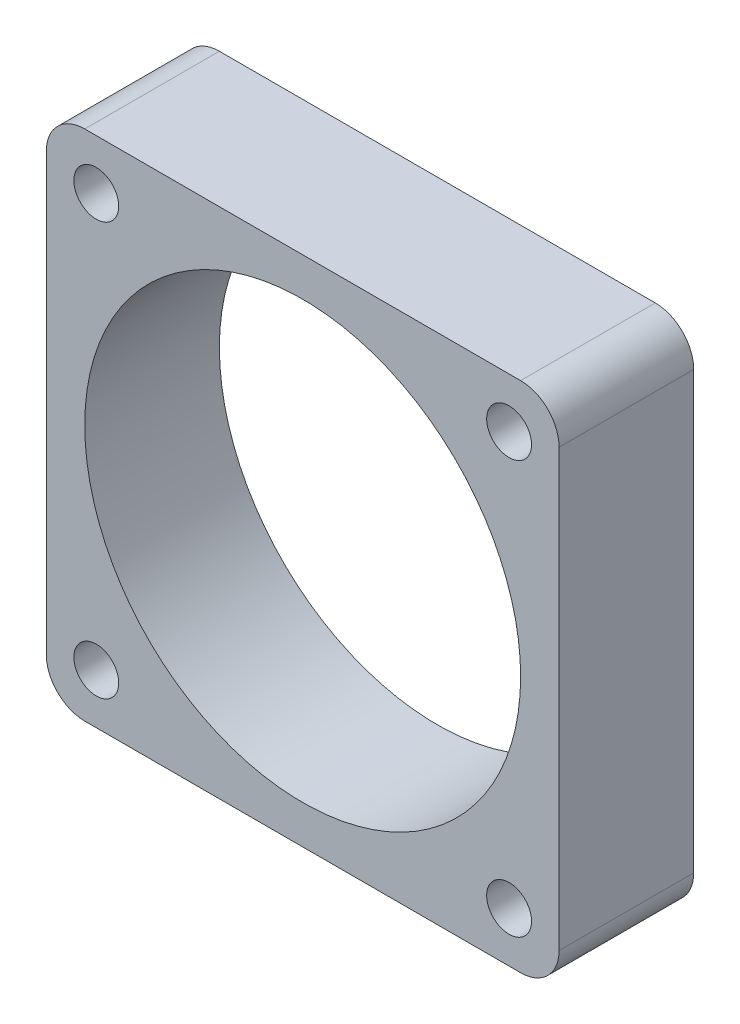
ISO-10303-21;
HEADER;
FILE_DESCRIPTION(('STEP AP214'),'2;1');
FILE_NAME('part.step','',(''),(''),'','','');
FILE_SCHEMA(('AUTOMOTIVE_DESIGN { 1 0 10303 214 1 1 1 1 }'));
ENDSEC;
DATA;
#1=APPLICATION_CONTEXT('core data for automotive mechanical design processes');
#2=APPLICATION_PROTOCOL_DEFINITION('international standard','automotive_design',2000,#1);
#3=PRODUCT_CONTEXT('',#1,'mechanical');
#4=PRODUCT('Part','Part','',(#3));
#5=PRODUCT_RELATED_PRODUCT_CATEGORY('part','',(#4));
#6=PRODUCT_DEFINITION_FORMATION('','',#4);
#7=PRODUCT_DEFINITION_CONTEXT('part definition',#1,'design');
#8=PRODUCT_DEFINITION('design','',#6,#7);
#9=PRODUCT_DEFINITION_SHAPE('','',#8);
#10=(LENGTH_UNIT() NAMED_UNIT(*) SI_UNIT(.MILLI.,.METRE.));
#11=(NAMED_UNIT(*) PLANE_ANGLE_UNIT() SI_UNIT($,.RADIAN.));
#12=(NAMED_UNIT(*) SI_UNIT($,.STERADIAN.) SOLID_ANGLE_UNIT());
#13=UNCERTAINTY_MEASURE_WITH_UNIT(LENGTH_MEASURE(1.E-05),#10,'distance_accuracy_value','');
#14=(GEOMETRIC_REPRESENTATION_CONTEXT(3) GLOBAL_UNCERTAINTY_ASSIGNED_CONTEXT((#13)) GLOBAL_UNIT_ASSIGNED_CONTEXT((#10,
#11,#12)) REPRESENTATION_CONTEXT('',''));
#15=CARTESIAN_POINT('',(0.,0.,0.));
#16=DIRECTION('',(0.,0.,1.));
#17=DIRECTION('',(1.,0.,0.));
#18=AXIS2_PLACEMENT_3D('',#15,#16,#17);
#19=CARTESIAN_POINT('',(37.,3.,10.5));
#20=DIRECTION('',(0.,0.,-1.));
#21=DIRECTION('',(-1.,0.,0.));
#22=AXIS2_PLACEMENT_3D('',#19,#20,#21);
#23=CYLINDRICAL_SURFACE('',#22,3.);
#24=CARTESIAN_POINT('',(37.,3.,0.));
#25=DIRECTION('',(0.,0.,1.));
#26=DIRECTION('',(1.,0.,0.));
#27=AXIS2_PLACEMENT_3D('',#24,#25,#26);
#28=CIRCLE('',#27,3.);
#29=CARTESIAN_POINT('',(37.,0.,0.));
#30=VERTEX_POINT('',#29);
#31=CARTESIAN_POINT('',(40.,3.00000000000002,0.));
#32=VERTEX_POINT('',#31);
#33=EDGE_CURVE('E131',#30,#32,#28,.T.);
#34=ORIENTED_EDGE('',*,*,#33,.T.);
#35=DIRECTION('',(0.,0.,-1.));
#36=VECTOR('',#35,1.);
#37=CARTESIAN_POINT('',(40.,3.00000000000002,10.5));
#38=LINE('',#37,#36);
#39=CARTESIAN_POINT('',(40.,3.00000000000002,10.5));
#40=VERTEX_POINT('',#39);
#41=EDGE_CURVE('E11',#40,#32,#38,.T.);
#42=ORIENTED_EDGE('',*,*,#41,.F.);
#43=CARTESIAN_POINT('',(37.,3.,10.5));
#44=DIRECTION('',(0.,0.,1.));
#45=DIRECTION('',(1.,0.,0.));
#46=AXIS2_PLACEMENT_3D('',#43,#44,#45);
#47=CIRCLE('',#46,3.);
#48=CARTESIAN_POINT('',(37.,0.,10.5));
#49=VERTEX_POINT('',#48);
#50=EDGE_CURVE('E146',#49,#40,#47,.T.);
#51=ORIENTED_EDGE('',*,*,#50,.F.);
#52=DIRECTION('',(0.,0.,-1.));
#53=VECTOR('',#52,1.);
#54=CARTESIAN_POINT('',(37.,0.,10.5));
#55=LINE('',#54,#53);
#56=EDGE_CURVE('E127',#49,#30,#55,.T.);
#57=ORIENTED_EDGE('',*,*,#56,.T.);
#58=EDGE_LOOP('',(#34,#42,#51,#57));
#59=FACE_BOUND('',#58,.T.);
#60=ADVANCED_FACE('F35',(#59),#23,.T.);
#61=CARTESIAN_POINT('',(40.,3.00000000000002,10.5));
#62=DIRECTION('',(-1.,0.,0.));
#63=DIRECTION('',(0.,0.,1.));
#64=AXIS2_PLACEMENT_3D('',#61,#62,#63);
#65=PLANE('',#64);
#66=DIRECTION('',(0.,1.,0.));
#67=VECTOR('',#66,1.);
#68=CARTESIAN_POINT('',(40.,3.00000000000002,0.));
#69=LINE('',#68,#67);
#70=CARTESIAN_POINT('',(40.,37.,0.));
#71=VERTEX_POINT('',#70);
#72=EDGE_CURVE('E134',#32,#71,#69,.T.);
#73=ORIENTED_EDGE('',*,*,#72,.T.);
#74=DIRECTION('',(0.,0.,-1.));
#75=VECTOR('',#74,1.);
#76=CARTESIAN_POINT('',(40.,37.,10.5));
#77=LINE('',#76,#75);
#78=CARTESIAN_POINT('',(40.,37.,10.5));
#79=VERTEX_POINT('',#78);
#80=EDGE_CURVE('E43',#79,#71,#77,.T.);
#81=ORIENTED_EDGE('',*,*,#80,.F.);
#82=DIRECTION('',(0.,1.,0.));
#83=VECTOR('',#82,1.);
#84=CARTESIAN_POINT('',(40.,3.00000000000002,10.5));
#85=LINE('',#84,#83);
#86=EDGE_CURVE('E94',#40,#79,#85,.T.);
#87=ORIENTED_EDGE('',*,*,#86,.F.);
#88=ORIENTED_EDGE('',*,*,#41,.T.);
#89=EDGE_LOOP('',(#73,#81,#87,#88));
#90=FACE_BOUND('',#89,.T.);
#91=ADVANCED_FACE('F242',(#90),#65,.F.);
#92=CARTESIAN_POINT('',(37.,37.,10.5));
#93=DIRECTION('',(0.,0.,-1.));
#94=DIRECTION('',(-1.,0.,0.));
#95=AXIS2_PLACEMENT_3D('',#92,#93,#94);
#96=CYLINDRICAL_SURFACE('',#95,3.);
#97=CARTESIAN_POINT('',(37.,37.,0.));
#98=DIRECTION('',(0.,0.,1.));
#99=DIRECTION('',(-1.,0.,0.));
#100=AXIS2_PLACEMENT_3D('',#97,#98,#99);
#101=CIRCLE('',#100,3.);
#102=CARTESIAN_POINT('',(37.,40.,0.));
#103=VERTEX_POINT('',#102);
#104=EDGE_CURVE('E137',#71,#103,#101,.T.);
#105=ORIENTED_EDGE('',*,*,#104,.T.);
#106=DIRECTION('',(0.,0.,-1.));
#107=VECTOR('',#106,1.);
#108=CARTESIAN_POINT('',(37.,40.,10.5));
#109=LINE('',#108,#107);
#110=CARTESIAN_POINT('',(37.,40.,10.5));
#111=VERTEX_POINT('',#110);
#112=EDGE_CURVE('E153',#111,#103,#109,.T.);
#113=ORIENTED_EDGE('',*,*,#112,.F.);
#114=CARTESIAN_POINT('',(37.,37.,10.5));
#115=DIRECTION('',(0.,0.,1.));
#116=DIRECTION('',(-1.,0.,0.));
#117=AXIS2_PLACEMENT_3D('',#114,#115,#116);
#118=CIRCLE('',#117,3.);
#119=EDGE_CURVE('E161',#79,#111,#118,.T.);
#120=ORIENTED_EDGE('',*,*,#119,.F.);
#121=ORIENTED_EDGE('',*,*,#80,.T.);
#122=EDGE_LOOP('',(#105,#113,#120,#121));
#123=FACE_BOUND('',#122,.T.);
#124=ADVANCED_FACE('F159',(#123),#96,.T.);
#125=CARTESIAN_POINT('',(3.00000000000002,40.,10.5));
#126=DIRECTION('',(0.,-1.,0.));
#127=DIRECTION('',(0.,0.,-1.));
#128=AXIS2_PLACEMENT_3D('',#125,#126,#127);
#129=PLANE('',#128);
#130=DIRECTION('',(-1.,0.,0.));
#131=VECTOR('',#130,1.);
#132=CARTESIAN_POINT('',(3.00000000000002,40.,0.));
#133=LINE('',#132,#131);
#134=CARTESIAN_POINT('',(3.00000000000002,40.,0.));
#135=VERTEX_POINT('',#134);
#136=EDGE_CURVE('E139',#103,#135,#133,.T.);
#137=ORIENTED_EDGE('',*,*,#136,.T.);
#138=DIRECTION('',(0.,0.,-1.));
#139=VECTOR('',#138,1.);
#140=CARTESIAN_POINT('',(3.00000000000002,40.,10.5));
#141=LINE('',#140,#139);
#142=CARTESIAN_POINT('',(3.00000000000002,40.,10.5));
#143=VERTEX_POINT('',#142);
#144=EDGE_CURVE('E150',#143,#135,#141,.T.);
#145=ORIENTED_EDGE('',*,*,#144,.F.);
#146=DIRECTION('',(-1.,0.,0.));
#147=VECTOR('',#146,1.);
#148=CARTESIAN_POINT('',(3.00000000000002,40.,10.5));
#149=LINE('',#148,#147);
#150=EDGE_CURVE('E173',#111,#143,#149,.T.);
#151=ORIENTED_EDGE('',*,*,#150,.F.);
#152=ORIENTED_EDGE('',*,*,#112,.T.);
#153=EDGE_LOOP('',(#137,#145,#151,#152));
#154=FACE_BOUND('',#153,.T.);
#155=ADVANCED_FACE('F169',(#154),#129,.F.);
#156=CARTESIAN_POINT('',(3.,37.,10.5));
#157=DIRECTION('',(0.,0.,-1.));
#158=DIRECTION('',(-1.,0.,0.));
#159=AXIS2_PLACEMENT_3D('',#156,#157,#158);
#160=CYLINDRICAL_SURFACE('',#159,3.);
#161=CARTESIAN_POINT('',(3.,37.,0.));
#162=DIRECTION('',(0.,0.,1.));
#163=DIRECTION('',(-1.,0.,0.));
#164=AXIS2_PLACEMENT_3D('',#161,#162,#163);
#165=CIRCLE('',#164,3.);
#166=CARTESIAN_POINT('',(0.,37.,0.));
#167=VERTEX_POINT('',#166);
#168=EDGE_CURVE('E141',#135,#167,#165,.T.);
#169=ORIENTED_EDGE('',*,*,#168,.T.);
#170=DIRECTION('',(0.,0.,-1.));
#171=VECTOR('',#170,1.);
#172=CARTESIAN_POINT('',(0.,37.,10.5));
#173=LINE('',#172,#171);
#174=CARTESIAN_POINT('',(0.,37.,10.5));
#175=VERTEX_POINT('',#174);
#176=EDGE_CURVE('E122',#175,#167,#173,.T.);
#177=ORIENTED_EDGE('',*,*,#176,.F.);
#178=CARTESIAN_POINT('',(3.,37.,10.5));
#179=DIRECTION('',(0.,0.,1.));
#180=DIRECTION('',(-1.,0.,0.));
#181=AXIS2_PLACEMENT_3D('',#178,#179,#180);
#182=CIRCLE('',#181,3.);
#183=EDGE_CURVE('E113',#143,#175,#182,.T.);
#184=ORIENTED_EDGE('',*,*,#183,.F.);
#185=ORIENTED_EDGE('',*,*,#144,.T.);
#186=EDGE_LOOP('',(#169,#177,#184,#185));
#187=FACE_BOUND('',#186,.T.);
#188=ADVANCED_FACE('F172',(#187),#160,.T.);
#189=CARTESIAN_POINT('',(0.,3.00000000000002,10.5));
#190=DIRECTION('',(1.,0.,0.));
#191=DIRECTION('',(0.,0.,-1.));
#192=AXIS2_PLACEMENT_3D('',#189,#190,#191);
#193=PLANE('',#192);
#194=DIRECTION('',(0.,-1.,0.));
#195=VECTOR('',#194,1.);
#196=CARTESIAN_POINT('',(0.,3.00000000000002,0.));
#197=LINE('',#196,#195);
#198=CARTESIAN_POINT('',(0.,3.,0.));
#199=VERTEX_POINT('',#198);
#200=EDGE_CURVE('E121',#167,#199,#197,.T.);
#201=ORIENTED_EDGE('',*,*,#200,.T.);
#202=DIRECTION('',(0.,0.,-1.));
#203=VECTOR('',#202,1.);
#204=CARTESIAN_POINT('',(0.,3.,10.5));
#205=LINE('',#204,#203);
#206=CARTESIAN_POINT('',(0.,3.,10.5));
#207=VERTEX_POINT('',#206);
#208=EDGE_CURVE('E118',#207,#199,#205,.T.);
#209=ORIENTED_EDGE('',*,*,#208,.F.);
#210=DIRECTION('',(0.,-1.,0.));
#211=VECTOR('',#210,1.);
#212=CARTESIAN_POINT('',(0.,3.00000000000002,10.5));
#213=LINE('',#212,#211);
#214=EDGE_CURVE('E107',#175,#207,#213,.T.);
#215=ORIENTED_EDGE('',*,*,#214,.F.);
#216=ORIENTED_EDGE('',*,*,#176,.T.);
#217=EDGE_LOOP('',(#201,#209,#215,#216));
#218=FACE_BOUND('',#217,.T.);
#219=ADVANCED_FACE('F119',(#218),#193,.F.);
#220=CARTESIAN_POINT('',(3.,3.,10.5));
#221=DIRECTION('',(0.,0.,-1.));
#222=DIRECTION('',(-1.,0.,0.));
#223=AXIS2_PLACEMENT_3D('',#220,#221,#222);
#224=CYLINDRICAL_SURFACE('',#223,3.);
#225=CARTESIAN_POINT('',(3.,3.,0.));
#226=DIRECTION('',(0.,0.,1.));
#227=DIRECTION('',(-1.,0.,0.));
#228=AXIS2_PLACEMENT_3D('',#225,#226,#227);
#229=CIRCLE('',#228,3.);
#230=CARTESIAN_POINT('',(3.00000000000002,0.,0.));
#231=VERTEX_POINT('',#230);
#232=EDGE_CURVE('E80',#199,#231,#229,.T.);
#233=ORIENTED_EDGE('',*,*,#232,.T.);
#234=DIRECTION('',(0.,0.,-1.));
#235=VECTOR('',#234,1.);
#236=CARTESIAN_POINT('',(3.00000000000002,0.,10.5));
#237=LINE('',#236,#235);
#238=CARTESIAN_POINT('',(3.00000000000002,0.,10.5));
#239=VERTEX_POINT('',#238);
#240=EDGE_CURVE('E123',#239,#231,#237,.T.);
#241=ORIENTED_EDGE('',*,*,#240,.F.);
#242=CARTESIAN_POINT('',(3.,3.,10.5));
#243=DIRECTION('',(0.,0.,1.));
#244=DIRECTION('',(-1.,0.,0.));
#245=AXIS2_PLACEMENT_3D('',#242,#243,#244);
#246=CIRCLE('',#245,3.);
#247=EDGE_CURVE('E111',#207,#239,#246,.T.);
#248=ORIENTED_EDGE('',*,*,#247,.F.);
#249=ORIENTED_EDGE('',*,*,#208,.T.);
#250=EDGE_LOOP('',(#233,#241,#248,#249));
#251=FACE_BOUND('',#250,.T.);
#252=ADVANCED_FACE('F125',(#251),#224,.T.);
#253=CARTESIAN_POINT('',(3.00000000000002,0.,10.5));
#254=DIRECTION('',(0.,1.,0.));
#255=DIRECTION('',(0.,0.,1.));
#256=AXIS2_PLACEMENT_3D('',#253,#254,#255);
#257=PLANE('',#256);
#258=DIRECTION('',(1.,0.,0.));
#259=VECTOR('',#258,1.);
#260=CARTESIAN_POINT('',(3.00000000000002,0.,0.));
#261=LINE('',#260,#259);
#262=EDGE_CURVE('E86',#231,#30,#261,.T.);
#263=ORIENTED_EDGE('',*,*,#262,.T.);
#264=ORIENTED_EDGE('',*,*,#56,.F.);
#265=DIRECTION('',(1.,0.,0.));
#266=VECTOR('',#265,1.);
#267=CARTESIAN_POINT('',(3.00000000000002,0.,10.5));
#268=LINE('',#267,#266);
#269=EDGE_CURVE('E51',#239,#49,#268,.T.);
#270=ORIENTED_EDGE('',*,*,#269,.F.);
#271=ORIENTED_EDGE('',*,*,#240,.T.);
#272=EDGE_LOOP('',(#263,#264,#270,#271));
#273=FACE_BOUND('',#272,.T.);
#274=ADVANCED_FACE('F214',(#273),#257,.F.);
#275=CARTESIAN_POINT('',(37.,3.,10.5));
#276=DIRECTION('',(0.,0.,1.));
#277=DIRECTION('',(1.,0.,0.));
#278=AXIS2_PLACEMENT_3D('',#275,#276,#277);
#279=PLANE('',#278);
#280=CARTESIAN_POINT('',(20.,20.,10.5));
#281=DIRECTION('',(0.,0.,1.));
#282=DIRECTION('',(1.,0.,0.));
#283=AXIS2_PLACEMENT_3D('',#280,#281,#282);
#284=CIRCLE('',#283,17.);
#285=CARTESIAN_POINT('',(37.,20.,10.5));
#286=VERTEX_POINT('',#285);
#287=EDGE_CURVE('E205',#286,#286,#284,.T.);
#288=ORIENTED_EDGE('',*,*,#287,.F.);
#289=EDGE_LOOP('',(#288));
#290=FACE_BOUND('',#289,.T.);
#291=CARTESIAN_POINT('',(36.1,36.1,10.5));
#292=DIRECTION('',(0.,0.,1.));
#293=DIRECTION('',(1.,0.,0.));
#294=AXIS2_PLACEMENT_3D('',#291,#292,#293);
#295=CIRCLE('',#294,1.75);
#296=CARTESIAN_POINT('',(37.85,36.1,10.5));
#297=VERTEX_POINT('',#296);
#298=EDGE_CURVE('E192',#297,#297,#295,.T.);
#299=ORIENTED_EDGE('',*,*,#298,.F.);
#300=EDGE_LOOP('',(#299));
#301=FACE_BOUND('',#300,.T.);
#302=CARTESIAN_POINT('',(3.9,3.9,10.5));
#303=DIRECTION('',(0.,0.,1.));
#304=DIRECTION('',(1.,0.,0.));
#305=AXIS2_PLACEMENT_3D('',#302,#303,#304);
#306=CIRCLE('',#305,1.75);
#307=CARTESIAN_POINT('',(5.65,3.9,10.5));
#308=VERTEX_POINT('',#307);
#309=EDGE_CURVE('E185',#308,#308,#306,.T.);
#310=ORIENTED_EDGE('',*,*,#309,.F.);
#311=EDGE_LOOP('',(#310));
#312=FACE_BOUND('',#311,.T.);
#313=CARTESIAN_POINT('',(36.1,3.9,10.5));
#314=DIRECTION('',(0.,0.,1.));
#315=DIRECTION('',(1.,0.,0.));
#316=AXIS2_PLACEMENT_3D('',#313,#314,#315);
#317=CIRCLE('',#316,1.75);
#318=CARTESIAN_POINT('',(37.85,3.9,10.5));
#319=VERTEX_POINT('',#318);
#320=EDGE_CURVE('E197',#319,#319,#317,.T.);
#321=ORIENTED_EDGE('',*,*,#320,.F.);
#322=EDGE_LOOP('',(#321));
#323=FACE_BOUND('',#322,.T.);
#324=CARTESIAN_POINT('',(3.9,36.1,10.5));
#325=DIRECTION('',(0.,0.,1.));
#326=DIRECTION('',(1.,0.,0.));
#327=AXIS2_PLACEMENT_3D('',#324,#325,#326);
#328=CIRCLE('',#327,1.75);
#329=CARTESIAN_POINT('',(5.65,36.1,10.5));
#330=VERTEX_POINT('',#329);
#331=EDGE_CURVE('E179',#330,#330,#328,.T.);
#332=ORIENTED_EDGE('',*,*,#331,.F.);
#333=EDGE_LOOP('',(#332));
#334=FACE_BOUND('',#333,.T.);
#335=ORIENTED_EDGE('',*,*,#50,.T.);
#336=ORIENTED_EDGE('',*,*,#86,.T.);
#337=ORIENTED_EDGE('',*,*,#119,.T.);
#338=ORIENTED_EDGE('',*,*,#150,.T.);
#339=ORIENTED_EDGE('',*,*,#183,.T.);
#340=ORIENTED_EDGE('',*,*,#214,.T.);
#341=ORIENTED_EDGE('',*,*,#247,.T.);
#342=ORIENTED_EDGE('',*,*,#269,.T.);
#343=EDGE_LOOP('',(#335,#336,#337,#338,#339,#340,#341,#342));
#344=FACE_BOUND('',#343,.T.);
#345=ADVANCED_FACE('F109',(#290,#301,#312,#323,#334,#344),#279,.T.);
#346=CARTESIAN_POINT('',(37.,3.,0.));
#347=DIRECTION('',(0.,0.,1.));
#348=DIRECTION('',(1.,0.,0.));
#349=AXIS2_PLACEMENT_3D('',#346,#347,#348);
#350=PLANE('',#349);
#351=CARTESIAN_POINT('',(20.,20.,0.));
#352=DIRECTION('',(0.,0.,1.));
#353=DIRECTION('',(1.,0.,0.));
#354=AXIS2_PLACEMENT_3D('',#351,#352,#353);
#355=CIRCLE('',#354,17.);
#356=CARTESIAN_POINT('',(37.,20.,0.));
#357=VERTEX_POINT('',#356);
#358=EDGE_CURVE('E200',#357,#357,#355,.F.);
#359=ORIENTED_EDGE('',*,*,#358,.F.);
#360=EDGE_LOOP('',(#359));
#361=FACE_BOUND('',#360,.T.);
#362=CARTESIAN_POINT('',(36.1,36.1,0.));
#363=DIRECTION('',(0.,0.,1.));
#364=DIRECTION('',(1.,0.,0.));
#365=AXIS2_PLACEMENT_3D('',#362,#363,#364);
#366=CIRCLE('',#365,1.75);
#367=CARTESIAN_POINT('',(37.85,36.1,0.));
#368=VERTEX_POINT('',#367);
#369=EDGE_CURVE('E182',#368,#368,#366,.T.);
#370=ORIENTED_EDGE('',*,*,#369,.T.);
#371=EDGE_LOOP('',(#370));
#372=FACE_BOUND('',#371,.T.);
#373=CARTESIAN_POINT('',(3.9,3.9,0.));
#374=DIRECTION('',(0.,0.,1.));
#375=DIRECTION('',(1.,0.,0.));
#376=AXIS2_PLACEMENT_3D('',#373,#374,#375);
#377=CIRCLE('',#376,1.75);
#378=CARTESIAN_POINT('',(5.65,3.9,0.));
#379=VERTEX_POINT('',#378);
#380=EDGE_CURVE('E188',#379,#379,#377,.T.);
#381=ORIENTED_EDGE('',*,*,#380,.T.);
#382=EDGE_LOOP('',(#381));
#383=FACE_BOUND('',#382,.T.);
#384=CARTESIAN_POINT('',(36.1,3.9,0.));
#385=DIRECTION('',(0.,0.,1.));
#386=DIRECTION('',(1.,0.,0.));
#387=AXIS2_PLACEMENT_3D('',#384,#385,#386);
#388=CIRCLE('',#387,1.75);
#389=CARTESIAN_POINT('',(37.85,3.9,0.));
#390=VERTEX_POINT('',#389);
#391=EDGE_CURVE('E189',#390,#390,#388,.T.);
#392=ORIENTED_EDGE('',*,*,#391,.T.);
#393=EDGE_LOOP('',(#392));
#394=FACE_BOUND('',#393,.T.);
#395=CARTESIAN_POINT('',(3.9,36.1,0.));
#396=DIRECTION('',(0.,0.,1.));
#397=DIRECTION('',(1.,0.,0.));
#398=AXIS2_PLACEMENT_3D('',#395,#396,#397);
#399=CIRCLE('',#398,1.75);
#400=CARTESIAN_POINT('',(5.65,36.1,0.));
#401=VERTEX_POINT('',#400);
#402=EDGE_CURVE('E135',#401,#401,#399,.T.);
#403=ORIENTED_EDGE('',*,*,#402,.T.);
#404=EDGE_LOOP('',(#403));
#405=FACE_BOUND('',#404,.T.);
#406=ORIENTED_EDGE('',*,*,#33,.F.);
#407=ORIENTED_EDGE('',*,*,#262,.F.);
#408=ORIENTED_EDGE('',*,*,#232,.F.);
#409=ORIENTED_EDGE('',*,*,#200,.F.);
#410=ORIENTED_EDGE('',*,*,#168,.F.);
#411=ORIENTED_EDGE('',*,*,#136,.F.);
#412=ORIENTED_EDGE('',*,*,#104,.F.);
#413=ORIENTED_EDGE('',*,*,#72,.F.);
#414=EDGE_LOOP('',(#406,#407,#408,#409,#410,#411,#412,#413));
#415=FACE_BOUND('',#414,.T.);
#416=ADVANCED_FACE('F165',(#361,#372,#383,#394,#405,#415),#350,.F.);
#417=CARTESIAN_POINT('',(3.9,36.1,0.));
#418=DIRECTION('',(0.,0.,1.));
#419=DIRECTION('',(1.,0.,0.));
#420=AXIS2_PLACEMENT_3D('',#417,#418,#419);
#421=CYLINDRICAL_SURFACE('',#420,1.75);
#422=CARTESIAN_POINT('',(5.65,36.1,0.));
#423=CARTESIAN_POINT('',(5.65,36.1,0.109375));
#424=CARTESIAN_POINT('',(5.65,36.1,0.21875));
#425=CARTESIAN_POINT('',(5.65,36.1,0.4375));
#426=CARTESIAN_POINT('',(5.65,36.1,0.546875));
#427=CARTESIAN_POINT('',(5.65,36.1,0.765625));
#428=CARTESIAN_POINT('',(5.65,36.1,0.875));
#429=CARTESIAN_POINT('',(5.65,36.1,1.09375));
#430=CARTESIAN_POINT('',(5.65,36.1,1.203125));
#431=CARTESIAN_POINT('',(5.65,36.1,1.421875));
#432=CARTESIAN_POINT('',(5.65,36.1,1.53125));
#433=CARTESIAN_POINT('',(5.65,36.1,1.75));
#434=CARTESIAN_POINT('',(5.65,36.1,1.859375));
#435=CARTESIAN_POINT('',(5.65,36.1,2.078125));
#436=CARTESIAN_POINT('',(5.65,36.1,2.1875));
#437=CARTESIAN_POINT('',(5.65,36.1,2.40625));
#438=CARTESIAN_POINT('',(5.65,36.1,2.515625));
#439=CARTESIAN_POINT('',(5.65,36.1,2.734375));
#440=CARTESIAN_POINT('',(5.65,36.1,2.84375));
#441=CARTESIAN_POINT('',(5.65,36.1,3.0625));
#442=CARTESIAN_POINT('',(5.65,36.1,3.171875));
#443=CARTESIAN_POINT('',(5.65,36.1,3.390625));
#444=CARTESIAN_POINT('',(5.65,36.1,3.5));
#445=CARTESIAN_POINT('',(5.65,36.1,3.71875));
#446=CARTESIAN_POINT('',(5.65,36.1,3.828125));
#447=CARTESIAN_POINT('',(5.65,36.1,4.046875));
#448=CARTESIAN_POINT('',(5.65,36.1,4.15625));
#449=CARTESIAN_POINT('',(5.65,36.1,4.375));
#450=CARTESIAN_POINT('',(5.65,36.1,4.484375));
#451=CARTESIAN_POINT('',(5.65,36.1,4.703125));
#452=CARTESIAN_POINT('',(5.65,36.1,4.8125));
#453=CARTESIAN_POINT('',(5.65,36.1,5.03125));
#454=CARTESIAN_POINT('',(5.65,36.1,5.140625));
#455=CARTESIAN_POINT('',(5.65,36.1,5.359375));
#456=CARTESIAN_POINT('',(5.65,36.1,5.46875));
#457=CARTESIAN_POINT('',(5.65,36.1,5.6875));
#458=CARTESIAN_POINT('',(5.65,36.1,5.796875));
#459=CARTESIAN_POINT('',(5.65,36.1,6.015625));
#460=CARTESIAN_POINT('',(5.65,36.1,6.125));
#461=CARTESIAN_POINT('',(5.65,36.1,6.34375));
#462=CARTESIAN_POINT('',(5.65,36.1,6.453125));
#463=CARTESIAN_POINT('',(5.65,36.1,6.671875));
#464=CARTESIAN_POINT('',(5.65,36.1,6.78125));
#465=CARTESIAN_POINT('',(5.65,36.1,7.));
#466=CARTESIAN_POINT('',(5.65,36.1,7.109375));
#467=CARTESIAN_POINT('',(5.65,36.1,7.328125));
#468=CARTESIAN_POINT('',(5.65,36.1,7.4375));
#469=CARTESIAN_POINT('',(5.65,36.1,7.65625));
#470=CARTESIAN_POINT('',(5.65,36.1,7.765625));
#471=CARTESIAN_POINT('',(5.65,36.1,7.984375));
#472=CARTESIAN_POINT('',(5.65,36.1,8.09375));
#473=CARTESIAN_POINT('',(5.65,36.1,8.3125));
#474=CARTESIAN_POINT('',(5.65,36.1,8.421875));
#475=CARTESIAN_POINT('',(5.65,36.1,8.640625));
#476=CARTESIAN_POINT('',(5.65,36.1,8.75));
#477=CARTESIAN_POINT('',(5.65,36.1,8.96875));
#478=CARTESIAN_POINT('',(5.65,36.1,9.078125));
#479=CARTESIAN_POINT('',(5.65,36.1,9.296875));
#480=CARTESIAN_POINT('',(5.65,36.1,9.40625));
#481=CARTESIAN_POINT('',(5.65,36.1,9.625));
#482=CARTESIAN_POINT('',(5.65,36.1,9.734375));
#483=CARTESIAN_POINT('',(5.65,36.1,9.953125));
#484=CARTESIAN_POINT('',(5.65,36.1,10.0625));
#485=CARTESIAN_POINT('',(5.65,36.1,10.28125));
#486=CARTESIAN_POINT('',(5.65,36.1,10.390625));
#487=CARTESIAN_POINT('',(5.65,36.1,10.5));
#488=B_SPLINE_CURVE_WITH_KNOTS('',3,(#422,#423,#424,#425,#426,#427,#428,#429,#430,#431,#432,
#433,#434,#435,#436,#437,#438,#439,#440,#441,#442,#443,#444,#445,#446,#447,#448,#449,#450,#451,
#452,#453,#454,#455,#456,#457,#458,#459,#460,#461,#462,#463,#464,#465,#466,#467,#468,#469,#470,
#471,#472,#473,#474,#475,#476,#477,#478,#479,#480,#481,#482,#483,#484,#485,#486,#487),
.UNSPECIFIED.,.F.,.F.,(4,2,2,2,2,2,2,2,2,2,2,2,2,2,2,2,2,2,2,2,2,2,2,2,2,2,2,2,2,2,2,2,4),(0.,
0.328125,0.65625,0.984375,1.3125,1.640625,1.96875,2.296875,2.625,2.953125,3.28125,3.609375,
3.9375,4.265625,4.59375,4.921875,5.25,5.578125,5.90625,6.234375,6.5625,6.890625,7.21875,
7.546875,7.875,8.203125,8.53125,8.859375,9.1875,9.515625,9.84375,10.171875,10.5),.UNSPECIFIED.);
#489=EDGE_CURVE('BSEAM224',#401,#330,#488,.T.);
#490=ORIENTED_EDGE('',*,*,#402,.F.);
#491=ORIENTED_EDGE('',*,*,#331,.T.);
#492=ORIENTED_EDGE('',*,*,#489,.T.);
#493=ORIENTED_EDGE('',*,*,#489,.F.);
#494=EDGE_LOOP('',(#490,#492,#491,#493));
#495=FACE_BOUND('',#494,.T.);
#496=ADVANCED_FACE('F224',(#495),#421,.F.);
#497=CARTESIAN_POINT('',(36.1,3.9,0.));
#498=DIRECTION('',(0.,0.,1.));
#499=DIRECTION('',(1.,0.,0.));
#500=AXIS2_PLACEMENT_3D('',#497,#498,#499);
#501=CYLINDRICAL_SURFACE('',#500,1.75);
#502=CARTESIAN_POINT('',(37.85,3.9,0.));
#503=CARTESIAN_POINT('',(37.85,3.9,0.109375));
#504=CARTESIAN_POINT('',(37.85,3.9,0.21875));
#505=CARTESIAN_POINT('',(37.85,3.9,0.4375));
#506=CARTESIAN_POINT('',(37.85,3.9,0.546875));
#507=CARTESIAN_POINT('',(37.85,3.9,0.765625));
#508=CARTESIAN_POINT('',(37.85,3.9,0.875));
#509=CARTESIAN_POINT('',(37.85,3.9,1.09375));
#510=CARTESIAN_POINT('',(37.85,3.9,1.203125));
#511=CARTESIAN_POINT('',(37.85,3.9,1.421875));
#512=CARTESIAN_POINT('',(37.85,3.9,1.53125));
#513=CARTESIAN_POINT('',(37.85,3.9,1.75));
#514=CARTESIAN_POINT('',(37.85,3.9,1.859375));
#515=CARTESIAN_POINT('',(37.85,3.9,2.078125));
#516=CARTESIAN_POINT('',(37.85,3.9,2.1875));
#517=CARTESIAN_POINT('',(37.85,3.9,2.40625));
#518=CARTESIAN_POINT('',(37.85,3.9,2.515625));
#519=CARTESIAN_POINT('',(37.85,3.9,2.734375));
#520=CARTESIAN_POINT('',(37.85,3.9,2.84375));
#521=CARTESIAN_POINT('',(37.85,3.9,3.0625));
#522=CARTESIAN_POINT('',(37.85,3.9,3.171875));
#523=CARTESIAN_POINT('',(37.85,3.9,3.390625));
#524=CARTESIAN_POINT('',(37.85,3.9,3.5));
#525=CARTESIAN_POINT('',(37.85,3.9,3.71875));
#526=CARTESIAN_POINT('',(37.85,3.9,3.828125));
#527=CARTESIAN_POINT('',(37.85,3.9,4.046875));
#528=CARTESIAN_POINT('',(37.85,3.9,4.15625));
#529=CARTESIAN_POINT('',(37.85,3.9,4.375));
#530=CARTESIAN_POINT('',(37.85,3.9,4.484375));
#531=CARTESIAN_POINT('',(37.85,3.9,4.703125));
#532=CARTESIAN_POINT('',(37.85,3.9,4.8125));
#533=CARTESIAN_POINT('',(37.85,3.9,5.03125));
#534=CARTESIAN_POINT('',(37.85,3.9,5.140625));
#535=CARTESIAN_POINT('',(37.85,3.9,5.359375));
#536=CARTESIAN_POINT('',(37.85,3.9,5.46875));
#537=CARTESIAN_POINT('',(37.85,3.9,5.6875));
#538=CARTESIAN_POINT('',(37.85,3.9,5.796875));
#539=CARTESIAN_POINT('',(37.85,3.9,6.015625));
#540=CARTESIAN_POINT('',(37.85,3.9,6.125));
#541=CARTESIAN_POINT('',(37.85,3.9,6.34375));
#542=CARTESIAN_POINT('',(37.85,3.9,6.453125));
#543=CARTESIAN_POINT('',(37.85,3.9,6.671875));
#544=CARTESIAN_POINT('',(37.85,3.9,6.78125));
#545=CARTESIAN_POINT('',(37.85,3.9,7.));
#546=CARTESIAN_POINT('',(37.85,3.9,7.109375));
#547=CARTESIAN_POINT('',(37.85,3.9,7.328125));
#548=CARTESIAN_POINT('',(37.85,3.9,7.4375));
#549=CARTESIAN_POINT('',(37.85,3.9,7.65625));
#550=CARTESIAN_POINT('',(37.85,3.9,7.765625));
#551=CARTESIAN_POINT('',(37.85,3.9,7.984375));
#552=CARTESIAN_POINT('',(37.85,3.9,8.09375));
#553=CARTESIAN_POINT('',(37.85,3.9,8.3125));
#554=CARTESIAN_POINT('',(37.85,3.9,8.421875));
#555=CARTESIAN_POINT('',(37.85,3.9,8.640625));
#556=CARTESIAN_POINT('',(37.85,3.9,8.75));
#557=CARTESIAN_POINT('',(37.85,3.9,8.96875));
#558=CARTESIAN_POINT('',(37.85,3.9,9.078125));
#559=CARTESIAN_POINT('',(37.85,3.9,9.296875));
#560=CARTESIAN_POINT('',(37.85,3.9,9.40625));
#561=CARTESIAN_POINT('',(37.85,3.9,9.625));
#562=CARTESIAN_POINT('',(37.85,3.9,9.734375));
#563=CARTESIAN_POINT('',(37.85,3.9,9.953125));
#564=CARTESIAN_POINT('',(37.85,3.9,10.0625));
#565=CARTESIAN_POINT('',(37.85,3.9,10.28125));
#566=CARTESIAN_POINT('',(37.85,3.9,10.390625));
#567=CARTESIAN_POINT('',(37.85,3.9,10.5));
#568=B_SPLINE_CURVE_WITH_KNOTS('',3,(#502,#503,#504,#505,#506,#507,#508,#509,#510,#511,#512,
#513,#514,#515,#516,#517,#518,#519,#520,#521,#522,#523,#524,#525,#526,#527,#528,#529,#530,#531,
#532,#533,#534,#535,#536,#537,#538,#539,#540,#541,#542,#543,#544,#545,#546,#547,#548,#549,#550,
#551,#552,#553,#554,#555,#556,#557,#558,#559,#560,#561,#562,#563,#564,#565,#566,#567),
.UNSPECIFIED.,.F.,.F.,(4,2,2,2,2,2,2,2,2,2,2,2,2,2,2,2,2,2,2,2,2,2,2,2,2,2,2,2,2,2,2,2,4),(0.,
0.328125,0.65625,0.984375,1.3125,1.640625,1.96875,2.296875,2.625,2.953125,3.28125,3.609375,
3.9375,4.265625,4.59375,4.921875,5.25,5.578125,5.90625,6.234375,6.5625,6.890625,7.21875,
7.546875,7.875,8.203125,8.53125,8.859375,9.1875,9.515625,9.84375,10.171875,10.5),.UNSPECIFIED.);
#569=EDGE_CURVE('BSEAM226',#390,#319,#568,.T.);
#570=ORIENTED_EDGE('',*,*,#391,.F.);
#571=ORIENTED_EDGE('',*,*,#320,.T.);
#572=ORIENTED_EDGE('',*,*,#569,.T.);
#573=ORIENTED_EDGE('',*,*,#569,.F.);
#574=EDGE_LOOP('',(#570,#572,#571,#573));
#575=FACE_BOUND('',#574,.T.);
#576=ADVANCED_FACE('F226',(#575),#501,.F.);
#577=CARTESIAN_POINT('',(3.9,3.9,0.));
#578=DIRECTION('',(0.,0.,1.));
#579=DIRECTION('',(1.,0.,0.));
#580=AXIS2_PLACEMENT_3D('',#577,#578,#579);
#581=CYLINDRICAL_SURFACE('',#580,1.75);
#582=CARTESIAN_POINT('',(5.65,3.9,0.));
#583=CARTESIAN_POINT('',(5.65,3.9,0.109375));
#584=CARTESIAN_POINT('',(5.65,3.9,0.21875));
#585=CARTESIAN_POINT('',(5.65,3.9,0.4375));
#586=CARTESIAN_POINT('',(5.65,3.9,0.546875));
#587=CARTESIAN_POINT('',(5.65,3.9,0.765625));
#588=CARTESIAN_POINT('',(5.65,3.9,0.875));
#589=CARTESIAN_POINT('',(5.65,3.9,1.09375));
#590=CARTESIAN_POINT('',(5.65,3.9,1.203125));
#591=CARTESIAN_POINT('',(5.65,3.9,1.421875));
#592=CARTESIAN_POINT('',(5.65,3.9,1.53125));
#593=CARTESIAN_POINT('',(5.65,3.9,1.75));
#594=CARTESIAN_POINT('',(5.65,3.9,1.859375));
#595=CARTESIAN_POINT('',(5.65,3.9,2.078125));
#596=CARTESIAN_POINT('',(5.65,3.9,2.1875));
#597=CARTESIAN_POINT('',(5.65,3.9,2.40625));
#598=CARTESIAN_POINT('',(5.65,3.9,2.515625));
#599=CARTESIAN_POINT('',(5.65,3.9,2.734375));
#600=CARTESIAN_POINT('',(5.65,3.9,2.84375));
#601=CARTESIAN_POINT('',(5.65,3.9,3.0625));
#602=CARTESIAN_POINT('',(5.65,3.9,3.171875));
#603=CARTESIAN_POINT('',(5.65,3.9,3.390625));
#604=CARTESIAN_POINT('',(5.65,3.9,3.5));
#605=CARTESIAN_POINT('',(5.65,3.9,3.71875));
#606=CARTESIAN_POINT('',(5.65,3.9,3.828125));
#607=CARTESIAN_POINT('',(5.65,3.9,4.046875));
#608=CARTESIAN_POINT('',(5.65,3.9,4.15625));
#609=CARTESIAN_POINT('',(5.65,3.9,4.375));
#610=CARTESIAN_POINT('',(5.65,3.9,4.484375));
#611=CARTESIAN_POINT('',(5.65,3.9,4.703125));
#612=CARTESIAN_POINT('',(5.65,3.9,4.8125));
#613=CARTESIAN_POINT('',(5.65,3.9,5.03125));
#614=CARTESIAN_POINT('',(5.65,3.9,5.140625));
#615=CARTESIAN_POINT('',(5.65,3.9,5.359375));
#616=CARTESIAN_POINT('',(5.65,3.9,5.46875));
#617=CARTESIAN_POINT('',(5.65,3.9,5.6875));
#618=CARTESIAN_POINT('',(5.65,3.9,5.796875));
#619=CARTESIAN_POINT('',(5.65,3.9,6.015625));
#620=CARTESIAN_POINT('',(5.65,3.9,6.125));
#621=CARTESIAN_POINT('',(5.65,3.9,6.34375));
#622=CARTESIAN_POINT('',(5.65,3.9,6.453125));
#623=CARTESIAN_POINT('',(5.65,3.9,6.671875));
#624=CARTESIAN_POINT('',(5.65,3.9,6.78125));
#625=CARTESIAN_POINT('',(5.65,3.9,7.));
#626=CARTESIAN_POINT('',(5.65,3.9,7.109375));
#627=CARTESIAN_POINT('',(5.65,3.9,7.328125));
#628=CARTESIAN_POINT('',(5.65,3.9,7.4375));
#629=CARTESIAN_POINT('',(5.65,3.9,7.65625));
#630=CARTESIAN_POINT('',(5.65,3.9,7.765625));
#631=CARTESIAN_POINT('',(5.65,3.9,7.984375));
#632=CARTESIAN_POINT('',(5.65,3.9,8.09375));
#633=CARTESIAN_POINT('',(5.65,3.9,8.3125));
#634=CARTESIAN_POINT('',(5.65,3.9,8.421875));
#635=CARTESIAN_POINT('',(5.65,3.9,8.640625));
#636=CARTESIAN_POINT('',(5.65,3.9,8.75));
#637=CARTESIAN_POINT('',(5.65,3.9,8.96875));
#638=CARTESIAN_POINT('',(5.65,3.9,9.078125));
#639=CARTESIAN_POINT('',(5.65,3.9,9.296875));
#640=CARTESIAN_POINT('',(5.65,3.9,9.40625));
#641=CARTESIAN_POINT('',(5.65,3.9,9.625));
#642=CARTESIAN_POINT('',(5.65,3.9,9.734375));
#643=CARTESIAN_POINT('',(5.65,3.9,9.953125));
#644=CARTESIAN_POINT('',(5.65,3.9,10.0625));
#645=CARTESIAN_POINT('',(5.65,3.9,10.28125));
#646=CARTESIAN_POINT('',(5.65,3.9,10.390625));
#647=CARTESIAN_POINT('',(5.65,3.9,10.5));
#648=B_SPLINE_CURVE_WITH_KNOTS('',3,(#582,#583,#584,#585,#586,#587,#588,#589,#590,#591,#592,
#593,#594,#595,#596,#597,#598,#599,#600,#601,#602,#603,#604,#605,#606,#607,#608,#609,#610,#611,
#612,#613,#614,#615,#616,#617,#618,#619,#620,#621,#622,#623,#624,#625,#626,#627,#628,#629,#630,
#631,#632,#633,#634,#635,#636,#637,#638,#639,#640,#641,#642,#643,#644,#645,#646,#647),
.UNSPECIFIED.,.F.,.F.,(4,2,2,2,2,2,2,2,2,2,2,2,2,2,2,2,2,2,2,2,2,2,2,2,2,2,2,2,2,2,2,2,4),(0.,
0.328125,0.65625,0.984375,1.3125,1.640625,1.96875,2.296875,2.625,2.953125,3.28125,3.609375,
3.9375,4.265625,4.59375,4.921875,5.25,5.578125,5.90625,6.234375,6.5625,6.890625,7.21875,
7.546875,7.875,8.203125,8.53125,8.859375,9.1875,9.515625,9.84375,10.171875,10.5),.UNSPECIFIED.);
#649=EDGE_CURVE('BSEAM233',#379,#308,#648,.T.);
#650=ORIENTED_EDGE('',*,*,#380,.F.);
#651=ORIENTED_EDGE('',*,*,#309,.T.);
#652=ORIENTED_EDGE('',*,*,#649,.T.);
#653=ORIENTED_EDGE('',*,*,#649,.F.);
#654=EDGE_LOOP('',(#650,#652,#651,#653));
#655=FACE_BOUND('',#654,.T.);
#656=ADVANCED_FACE('F233',(#655),#581,.F.);
#657=CARTESIAN_POINT('',(36.1,36.1,0.));
#658=DIRECTION('',(0.,0.,1.));
#659=DIRECTION('',(1.,0.,0.));
#660=AXIS2_PLACEMENT_3D('',#657,#658,#659);
#661=CYLINDRICAL_SURFACE('',#660,1.75);
#662=CARTESIAN_POINT('',(37.85,36.1,0.));
#663=CARTESIAN_POINT('',(37.85,36.1,0.109375));
#664=CARTESIAN_POINT('',(37.85,36.1,0.21875));
#665=CARTESIAN_POINT('',(37.85,36.1,0.4375));
#666=CARTESIAN_POINT('',(37.85,36.1,0.546875));
#667=CARTESIAN_POINT('',(37.85,36.1,0.765625));
#668=CARTESIAN_POINT('',(37.85,36.1,0.875));
#669=CARTESIAN_POINT('',(37.85,36.1,1.09375));
#670=CARTESIAN_POINT('',(37.85,36.1,1.203125));
#671=CARTESIAN_POINT('',(37.85,36.1,1.421875));
#672=CARTESIAN_POINT('',(37.85,36.1,1.53125));
#673=CARTESIAN_POINT('',(37.85,36.1,1.75));
#674=CARTESIAN_POINT('',(37.85,36.1,1.859375));
#675=CARTESIAN_POINT('',(37.85,36.1,2.078125));
#676=CARTESIAN_POINT('',(37.85,36.1,2.1875));
#677=CARTESIAN_POINT('',(37.85,36.1,2.40625));
#678=CARTESIAN_POINT('',(37.85,36.1,2.515625));
#679=CARTESIAN_POINT('',(37.85,36.1,2.734375));
#680=CARTESIAN_POINT('',(37.85,36.1,2.84375));
#681=CARTESIAN_POINT('',(37.85,36.1,3.0625));
#682=CARTESIAN_POINT('',(37.85,36.1,3.171875));
#683=CARTESIAN_POINT('',(37.85,36.1,3.390625));
#684=CARTESIAN_POINT('',(37.85,36.1,3.5));
#685=CARTESIAN_POINT('',(37.85,36.1,3.71875));
#686=CARTESIAN_POINT('',(37.85,36.1,3.828125));
#687=CARTESIAN_POINT('',(37.85,36.1,4.046875));
#688=CARTESIAN_POINT('',(37.85,36.1,4.15625));
#689=CARTESIAN_POINT('',(37.85,36.1,4.375));
#690=CARTESIAN_POINT('',(37.85,36.1,4.484375));
#691=CARTESIAN_POINT('',(37.85,36.1,4.703125));
#692=CARTESIAN_POINT('',(37.85,36.1,4.8125));
#693=CARTESIAN_POINT('',(37.85,36.1,5.03125));
#694=CARTESIAN_POINT('',(37.85,36.1,5.140625));
#695=CARTESIAN_POINT('',(37.85,36.1,5.359375));
#696=CARTESIAN_POINT('',(37.85,36.1,5.46875));
#697=CARTESIAN_POINT('',(37.85,36.1,5.6875));
#698=CARTESIAN_POINT('',(37.85,36.1,5.796875));
#699=CARTESIAN_POINT('',(37.85,36.1,6.015625));
#700=CARTESIAN_POINT('',(37.85,36.1,6.125));
#701=CARTESIAN_POINT('',(37.85,36.1,6.34375));
#702=CARTESIAN_POINT('',(37.85,36.1,6.453125));
#703=CARTESIAN_POINT('',(37.85,36.1,6.671875));
#704=CARTESIAN_POINT('',(37.85,36.1,6.78125));
#705=CARTESIAN_POINT('',(37.85,36.1,7.));
#706=CARTESIAN_POINT('',(37.85,36.1,7.109375));
#707=CARTESIAN_POINT('',(37.85,36.1,7.328125));
#708=CARTESIAN_POINT('',(37.85,36.1,7.4375));
#709=CARTESIAN_POINT('',(37.85,36.1,7.65625));
#710=CARTESIAN_POINT('',(37.85,36.1,7.765625));
#711=CARTESIAN_POINT('',(37.85,36.1,7.984375));
#712=CARTESIAN_POINT('',(37.85,36.1,8.09375));
#713=CARTESIAN_POINT('',(37.85,36.1,8.3125));
#714=CARTESIAN_POINT('',(37.85,36.1,8.421875));
#715=CARTESIAN_POINT('',(37.85,36.1,8.640625));
#716=CARTESIAN_POINT('',(37.85,36.1,8.75));
#717=CARTESIAN_POINT('',(37.85,36.1,8.96875));
#718=CARTESIAN_POINT('',(37.85,36.1,9.078125));
#719=CARTESIAN_POINT('',(37.85,36.1,9.296875));
#720=CARTESIAN_POINT('',(37.85,36.1,9.40625));
#721=CARTESIAN_POINT('',(37.85,36.1,9.625));
#722=CARTESIAN_POINT('',(37.85,36.1,9.734375));
#723=CARTESIAN_POINT('',(37.85,36.1,9.953125));
#724=CARTESIAN_POINT('',(37.85,36.1,10.0625));
#725=CARTESIAN_POINT('',(37.85,36.1,10.28125));
#726=CARTESIAN_POINT('',(37.85,36.1,10.390625));
#727=CARTESIAN_POINT('',(37.85,36.1,10.5));
#728=B_SPLINE_CURVE_WITH_KNOTS('',3,(#662,#663,#664,#665,#666,#667,#668,#669,#670,#671,#672,
#673,#674,#675,#676,#677,#678,#679,#680,#681,#682,#683,#684,#685,#686,#687,#688,#689,#690,#691,
#692,#693,#694,#695,#696,#697,#698,#699,#700,#701,#702,#703,#704,#705,#706,#707,#708,#709,#710,
#711,#712,#713,#714,#715,#716,#717,#718,#719,#720,#721,#722,#723,#724,#725,#726,#727),
.UNSPECIFIED.,.F.,.F.,(4,2,2,2,2,2,2,2,2,2,2,2,2,2,2,2,2,2,2,2,2,2,2,2,2,2,2,2,2,2,2,2,4),(0.,
0.328125,0.65625,0.984375,1.3125,1.640625,1.96875,2.296875,2.625,2.953125,3.28125,3.609375,
3.9375,4.265625,4.59375,4.921875,5.25,5.578125,5.90625,6.234375,6.5625,6.890625,7.21875,
7.546875,7.875,8.203125,8.53125,8.859375,9.1875,9.515625,9.84375,10.171875,10.5),.UNSPECIFIED.);
#729=EDGE_CURVE('BSEAM309',#368,#297,#728,.T.);
#730=ORIENTED_EDGE('',*,*,#369,.F.);
#731=ORIENTED_EDGE('',*,*,#298,.T.);
#732=ORIENTED_EDGE('',*,*,#729,.T.);
#733=ORIENTED_EDGE('',*,*,#729,.F.);
#734=EDGE_LOOP('',(#730,#732,#731,#733));
#735=FACE_BOUND('',#734,.T.);
#736=ADVANCED_FACE('F309',(#735),#661,.F.);
#737=CARTESIAN_POINT('',(20.,20.,-0.000999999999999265));
#738=DIRECTION('',(0.,0.,1.));
#739=DIRECTION('',(1.,0.,0.));
#740=AXIS2_PLACEMENT_3D('',#737,#738,#739);
#741=CYLINDRICAL_SURFACE('',#740,17.);
#742=ORIENTED_EDGE('',*,*,#287,.T.);
#743=EDGE_LOOP('',(#742));
#744=FACE_BOUND('',#743,.T.);
#745=ORIENTED_EDGE('',*,*,#358,.T.);
#746=EDGE_LOOP('',(#745));
#747=FACE_BOUND('',#746,.T.);
#748=ADVANCED_FACE('F209',(#744,#747),#741,.F.);
#749=CLOSED_SHELL('',(#60,#91,#124,#155,#188,#219,#252,#274,#345,#416,#496,#576,#656,#736,#748));
#750=MANIFOLD_SOLID_BREP('B2',#749);
#751=ADVANCED_BREP_SHAPE_REPRESENTATION('',(#18,#750),#14);
#752=SHAPE_DEFINITION_REPRESENTATION(#9,#751);
ENDSEC;
END-ISO-10303-21;
